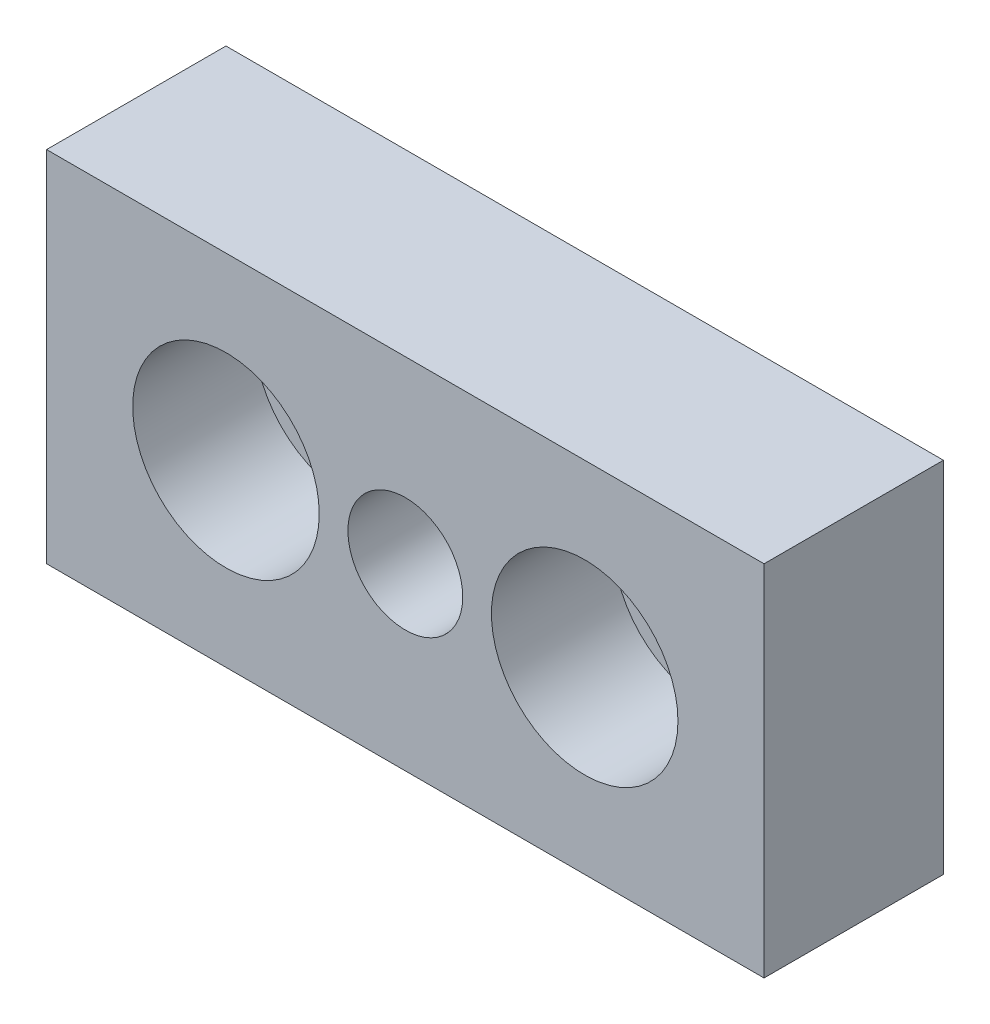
ISO-10303-21;
HEADER;
FILE_DESCRIPTION(('STEP AP214'),'2;1');
FILE_NAME('part.step','',(''),(''),'','','');
FILE_SCHEMA(('AUTOMOTIVE_DESIGN { 1 0 10303 214 1 1 1 1 }'));
ENDSEC;
DATA;
#1=APPLICATION_CONTEXT('core data for automotive mechanical design processes');
#2=APPLICATION_PROTOCOL_DEFINITION('international standard','automotive_design',2000,#1);
#3=PRODUCT_CONTEXT('',#1,'mechanical');
#4=PRODUCT('Part','Part','',(#3));
#5=PRODUCT_RELATED_PRODUCT_CATEGORY('part','',(#4));
#6=PRODUCT_DEFINITION_FORMATION('','',#4);
#7=PRODUCT_DEFINITION_CONTEXT('part definition',#1,'design');
#8=PRODUCT_DEFINITION('design','',#6,#7);
#9=PRODUCT_DEFINITION_SHAPE('','',#8);
#10=(LENGTH_UNIT() NAMED_UNIT(*) SI_UNIT(.MILLI.,.METRE.));
#11=(NAMED_UNIT(*) PLANE_ANGLE_UNIT() SI_UNIT($,.RADIAN.));
#12=(NAMED_UNIT(*) SI_UNIT($,.STERADIAN.) SOLID_ANGLE_UNIT());
#13=UNCERTAINTY_MEASURE_WITH_UNIT(LENGTH_MEASURE(1.E-05),#10,'distance_accuracy_value','');
#14=(GEOMETRIC_REPRESENTATION_CONTEXT(3) GLOBAL_UNCERTAINTY_ASSIGNED_CONTEXT((#13)) GLOBAL_UNIT_ASSIGNED_CONTEXT((#10,
#11,#12)) REPRESENTATION_CONTEXT('',''));
#15=CARTESIAN_POINT('',(0.,0.,0.));
#16=DIRECTION('',(0.,0.,1.));
#17=DIRECTION('',(1.,0.,0.));
#18=AXIS2_PLACEMENT_3D('',#15,#16,#17);
#19=CARTESIAN_POINT('',(-25.,25.,25.));
#20=DIRECTION('',(0.,0.,-1.));
#21=DIRECTION('',(-1.,0.,0.));
#22=AXIS2_PLACEMENT_3D('',#19,#20,#21);
#23=PLANE('',#22);
#24=CARTESIAN_POINT('',(0.,0.,25.));
#25=DIRECTION('',(0.,0.,1.));
#26=DIRECTION('',(1.,0.,0.));
#27=AXIS2_PLACEMENT_3D('',#24,#25,#26);
#28=CIRCLE('',#27,13.);
#29=CARTESIAN_POINT('',(13.,0.,25.));
#30=VERTEX_POINT('',#29);
#31=EDGE_CURVE('E164',#30,#30,#28,.T.);
#32=ORIENTED_EDGE('',*,*,#31,.F.);
#33=EDGE_LOOP('',(#32));
#34=FACE_BOUND('',#33,.T.);
#35=DIRECTION('',(0.,1.,0.));
#36=VECTOR('',#35,1.);
#37=CARTESIAN_POINT('',(-25.,-25.,25.));
#38=LINE('',#37,#36);
#39=CARTESIAN_POINT('',(-25.,-25.,25.));
#40=VERTEX_POINT('',#39);
#41=CARTESIAN_POINT('',(-25.,25.,25.));
#42=VERTEX_POINT('',#41);
#43=EDGE_CURVE('E66',#40,#42,#38,.T.);
#44=ORIENTED_EDGE('',*,*,#43,.F.);
#45=DIRECTION('',(-1.,0.,0.));
#46=VECTOR('',#45,1.);
#47=CARTESIAN_POINT('',(75.,-25.,25.));
#48=LINE('',#47,#46);
#49=CARTESIAN_POINT('',(75.,-25.,25.));
#50=VERTEX_POINT('',#49);
#51=EDGE_CURVE('E48',#50,#40,#48,.T.);
#52=ORIENTED_EDGE('',*,*,#51,.F.);
#53=DIRECTION('',(0.,-1.,0.));
#54=VECTOR('',#53,1.);
#55=CARTESIAN_POINT('',(75.,25.,25.));
#56=LINE('',#55,#54);
#57=CARTESIAN_POINT('',(75.,25.,25.));
#58=VERTEX_POINT('',#57);
#59=EDGE_CURVE('E57',#58,#50,#56,.T.);
#60=ORIENTED_EDGE('',*,*,#59,.F.);
#61=DIRECTION('',(1.,0.,0.));
#62=VECTOR('',#61,1.);
#63=CARTESIAN_POINT('',(-25.,25.,25.));
#64=LINE('',#63,#62);
#65=EDGE_CURVE('E62',#42,#58,#64,.T.);
#66=ORIENTED_EDGE('',*,*,#65,.F.);
#67=EDGE_LOOP('',(#44,#52,#60,#66));
#68=FACE_BOUND('',#67,.T.);
#69=CARTESIAN_POINT('',(25.,0.,25.));
#70=DIRECTION('',(0.,0.,1.));
#71=DIRECTION('',(1.,0.,0.));
#72=AXIS2_PLACEMENT_3D('',#69,#70,#71);
#73=CIRCLE('',#72,8.);
#74=CARTESIAN_POINT('',(33.,0.,25.));
#75=VERTEX_POINT('',#74);
#76=EDGE_CURVE('E84',#75,#75,#73,.T.);
#77=ORIENTED_EDGE('',*,*,#76,.F.);
#78=EDGE_LOOP('',(#77));
#79=FACE_BOUND('',#78,.T.);
#80=CARTESIAN_POINT('',(50.,0.,25.));
#81=DIRECTION('',(0.,0.,1.));
#82=DIRECTION('',(1.,0.,0.));
#83=AXIS2_PLACEMENT_3D('',#80,#81,#82);
#84=CIRCLE('',#83,13.);
#85=CARTESIAN_POINT('',(63.,0.,25.));
#86=VERTEX_POINT('',#85);
#87=EDGE_CURVE('E152',#86,#86,#84,.T.);
#88=ORIENTED_EDGE('',*,*,#87,.F.);
#89=EDGE_LOOP('',(#88));
#90=FACE_BOUND('',#89,.T.);
#91=ADVANCED_FACE('F14',(#34,#68,#79,#90),#23,.F.);
#92=CARTESIAN_POINT('',(-25.,25.,0.));
#93=DIRECTION('',(0.,0.,-1.));
#94=DIRECTION('',(-1.,0.,0.));
#95=AXIS2_PLACEMENT_3D('',#92,#93,#94);
#96=PLANE('',#95);
#97=CARTESIAN_POINT('',(0.,0.,0.));
#98=DIRECTION('',(0.,0.,1.));
#99=DIRECTION('',(1.,0.,0.));
#100=AXIS2_PLACEMENT_3D('',#97,#98,#99);
#101=CIRCLE('',#100,9.);
#102=CARTESIAN_POINT('',(9.,0.,0.));
#103=VERTEX_POINT('',#102);
#104=EDGE_CURVE('E155',#103,#103,#101,.T.);
#105=ORIENTED_EDGE('',*,*,#104,.T.);
#106=EDGE_LOOP('',(#105));
#107=FACE_BOUND('',#106,.T.);
#108=DIRECTION('',(0.,1.,0.));
#109=VECTOR('',#108,1.);
#110=CARTESIAN_POINT('',(-25.,-25.,0.));
#111=LINE('',#110,#109);
#112=CARTESIAN_POINT('',(-25.,-25.,0.));
#113=VERTEX_POINT('',#112);
#114=CARTESIAN_POINT('',(-25.,25.,0.));
#115=VERTEX_POINT('',#114);
#116=EDGE_CURVE('E67',#113,#115,#111,.T.);
#117=ORIENTED_EDGE('',*,*,#116,.T.);
#118=DIRECTION('',(1.,0.,0.));
#119=VECTOR('',#118,1.);
#120=CARTESIAN_POINT('',(-25.,25.,0.));
#121=LINE('',#120,#119);
#122=CARTESIAN_POINT('',(75.,25.,0.));
#123=VERTEX_POINT('',#122);
#124=EDGE_CURVE('E70',#115,#123,#121,.T.);
#125=ORIENTED_EDGE('',*,*,#124,.T.);
#126=DIRECTION('',(0.,-1.,0.));
#127=VECTOR('',#126,1.);
#128=CARTESIAN_POINT('',(75.,25.,0.));
#129=LINE('',#128,#127);
#130=CARTESIAN_POINT('',(75.,-25.,0.));
#131=VERTEX_POINT('',#130);
#132=EDGE_CURVE('E80',#123,#131,#129,.T.);
#133=ORIENTED_EDGE('',*,*,#132,.T.);
#134=DIRECTION('',(-1.,0.,0.));
#135=VECTOR('',#134,1.);
#136=CARTESIAN_POINT('',(75.,-25.,0.));
#137=LINE('',#136,#135);
#138=EDGE_CURVE('E51',#131,#113,#137,.T.);
#139=ORIENTED_EDGE('',*,*,#138,.T.);
#140=EDGE_LOOP('',(#117,#125,#133,#139));
#141=FACE_BOUND('',#140,.T.);
#142=CARTESIAN_POINT('',(25.,0.,0.));
#143=DIRECTION('',(0.,0.,1.));
#144=DIRECTION('',(1.,0.,0.));
#145=AXIS2_PLACEMENT_3D('',#142,#143,#144);
#146=CIRCLE('',#145,8.);
#147=CARTESIAN_POINT('',(33.,0.,0.));
#148=VERTEX_POINT('',#147);
#149=EDGE_CURVE('E167',#148,#148,#146,.T.);
#150=ORIENTED_EDGE('',*,*,#149,.T.);
#151=EDGE_LOOP('',(#150));
#152=FACE_BOUND('',#151,.T.);
#153=CARTESIAN_POINT('',(50.,0.,0.));
#154=DIRECTION('',(0.,0.,1.));
#155=DIRECTION('',(1.,0.,0.));
#156=AXIS2_PLACEMENT_3D('',#153,#154,#155);
#157=CIRCLE('',#156,9.);
#158=CARTESIAN_POINT('',(59.,0.,0.));
#159=VERTEX_POINT('',#158);
#160=EDGE_CURVE('E144',#159,#159,#157,.T.);
#161=ORIENTED_EDGE('',*,*,#160,.T.);
#162=EDGE_LOOP('',(#161));
#163=FACE_BOUND('',#162,.T.);
#164=ADVANCED_FACE('F78',(#107,#141,#152,#163),#96,.T.);
#165=CARTESIAN_POINT('',(-25.,-25.,25.));
#166=DIRECTION('',(-1.,0.,0.));
#167=DIRECTION('',(0.,0.,1.));
#168=AXIS2_PLACEMENT_3D('',#165,#166,#167);
#169=PLANE('',#168);
#170=DIRECTION('',(0.,0.,-1.));
#171=VECTOR('',#170,1.);
#172=CARTESIAN_POINT('',(-25.,-25.,25.));
#173=LINE('',#172,#171);
#174=EDGE_CURVE('E9',#40,#113,#173,.T.);
#175=ORIENTED_EDGE('',*,*,#174,.F.);
#176=ORIENTED_EDGE('',*,*,#43,.T.);
#177=DIRECTION('',(0.,0.,-1.));
#178=VECTOR('',#177,1.);
#179=CARTESIAN_POINT('',(-25.,25.,25.));
#180=LINE('',#179,#178);
#181=EDGE_CURVE('E30',#42,#115,#180,.T.);
#182=ORIENTED_EDGE('',*,*,#181,.T.);
#183=ORIENTED_EDGE('',*,*,#116,.F.);
#184=EDGE_LOOP('',(#175,#176,#182,#183));
#185=FACE_BOUND('',#184,.T.);
#186=ADVANCED_FACE('F88',(#185),#169,.T.);
#187=CARTESIAN_POINT('',(75.,-25.,25.));
#188=DIRECTION('',(0.,-1.,0.));
#189=DIRECTION('',(1.,0.,0.));
#190=AXIS2_PLACEMENT_3D('',#187,#188,#189);
#191=PLANE('',#190);
#192=DIRECTION('',(0.,0.,-1.));
#193=VECTOR('',#192,1.);
#194=CARTESIAN_POINT('',(75.,-25.,25.));
#195=LINE('',#194,#193);
#196=EDGE_CURVE('E23',#50,#131,#195,.T.);
#197=ORIENTED_EDGE('',*,*,#196,.F.);
#198=ORIENTED_EDGE('',*,*,#51,.T.);
#199=ORIENTED_EDGE('',*,*,#174,.T.);
#200=ORIENTED_EDGE('',*,*,#138,.F.);
#201=EDGE_LOOP('',(#197,#198,#199,#200));
#202=FACE_BOUND('',#201,.T.);
#203=ADVANCED_FACE('F16',(#202),#191,.T.);
#204=CARTESIAN_POINT('',(75.,25.,25.));
#205=DIRECTION('',(1.,0.,0.));
#206=DIRECTION('',(0.,1.,0.));
#207=AXIS2_PLACEMENT_3D('',#204,#205,#206);
#208=PLANE('',#207);
#209=DIRECTION('',(0.,0.,-1.));
#210=VECTOR('',#209,1.);
#211=CARTESIAN_POINT('',(75.,25.,25.));
#212=LINE('',#211,#210);
#213=EDGE_CURVE('E55',#58,#123,#212,.T.);
#214=ORIENTED_EDGE('',*,*,#213,.F.);
#215=ORIENTED_EDGE('',*,*,#59,.T.);
#216=ORIENTED_EDGE('',*,*,#196,.T.);
#217=ORIENTED_EDGE('',*,*,#132,.F.);
#218=EDGE_LOOP('',(#214,#215,#216,#217));
#219=FACE_BOUND('',#218,.T.);
#220=ADVANCED_FACE('F58',(#219),#208,.T.);
#221=CARTESIAN_POINT('',(-25.,25.,25.));
#222=DIRECTION('',(0.,1.,0.));
#223=DIRECTION('',(0.,0.,1.));
#224=AXIS2_PLACEMENT_3D('',#221,#222,#223);
#225=PLANE('',#224);
#226=ORIENTED_EDGE('',*,*,#65,.T.);
#227=ORIENTED_EDGE('',*,*,#213,.T.);
#228=ORIENTED_EDGE('',*,*,#124,.F.);
#229=ORIENTED_EDGE('',*,*,#181,.F.);
#230=EDGE_LOOP('',(#226,#227,#228,#229));
#231=FACE_BOUND('',#230,.T.);
#232=ADVANCED_FACE('F76',(#231),#225,.T.);
#233=CARTESIAN_POINT('',(25.,0.,25.));
#234=DIRECTION('',(0.,0.,-1.));
#235=DIRECTION('',(-1.,0.,0.));
#236=AXIS2_PLACEMENT_3D('',#233,#234,#235);
#237=CYLINDRICAL_SURFACE('',#236,8.);
#238=ORIENTED_EDGE('',*,*,#76,.T.);
#239=EDGE_LOOP('',(#238));
#240=FACE_BOUND('',#239,.T.);
#241=ORIENTED_EDGE('',*,*,#149,.F.);
#242=EDGE_LOOP('',(#241));
#243=FACE_BOUND('',#242,.T.);
#244=ADVANCED_FACE('F109',(#240,#243),#237,.F.);
#245=CARTESIAN_POINT('',(0.,0.,25.));
#246=DIRECTION('',(0.,0.,1.));
#247=DIRECTION('',(1.,0.,0.));
#248=AXIS2_PLACEMENT_3D('',#245,#246,#247);
#249=CYLINDRICAL_SURFACE('',#248,13.);
#250=ORIENTED_EDGE('',*,*,#31,.T.);
#251=EDGE_LOOP('',(#250));
#252=FACE_BOUND('',#251,.T.);
#253=CARTESIAN_POINT('',(0.,0.,8.));
#254=DIRECTION('',(0.,0.,1.));
#255=DIRECTION('',(1.,0.,0.));
#256=AXIS2_PLACEMENT_3D('',#253,#254,#255);
#257=CIRCLE('',#256,13.);
#258=CARTESIAN_POINT('',(13.,0.,8.));
#259=VERTEX_POINT('',#258);
#260=EDGE_CURVE('E161',#259,#259,#257,.T.);
#261=ORIENTED_EDGE('',*,*,#260,.F.);
#262=EDGE_LOOP('',(#261));
#263=FACE_BOUND('',#262,.T.);
#264=ADVANCED_FACE('F112',(#252,#263),#249,.F.);
#265=CARTESIAN_POINT('',(9.,0.,8.));
#266=DIRECTION('',(0.,0.,1.));
#267=DIRECTION('',(1.,0.,0.));
#268=AXIS2_PLACEMENT_3D('',#265,#266,#267);
#269=PLANE('',#268);
#270=ORIENTED_EDGE('',*,*,#260,.T.);
#271=EDGE_LOOP('',(#270));
#272=FACE_BOUND('',#271,.T.);
#273=CARTESIAN_POINT('',(0.,0.,8.));
#274=DIRECTION('',(0.,0.,1.));
#275=DIRECTION('',(1.,0.,0.));
#276=AXIS2_PLACEMENT_3D('',#273,#274,#275);
#277=CIRCLE('',#276,9.);
#278=CARTESIAN_POINT('',(9.,0.,8.));
#279=VERTEX_POINT('',#278);
#280=EDGE_CURVE('E158',#279,#279,#277,.T.);
#281=ORIENTED_EDGE('',*,*,#280,.F.);
#282=EDGE_LOOP('',(#281));
#283=FACE_BOUND('',#282,.T.);
#284=ADVANCED_FACE('F116',(#272,#283),#269,.T.);
#285=CARTESIAN_POINT('',(0.,0.,25.));
#286=DIRECTION('',(0.,0.,1.));
#287=DIRECTION('',(1.,0.,0.));
#288=AXIS2_PLACEMENT_3D('',#285,#286,#287);
#289=CYLINDRICAL_SURFACE('',#288,9.);
#290=ORIENTED_EDGE('',*,*,#280,.T.);
#291=EDGE_LOOP('',(#290));
#292=FACE_BOUND('',#291,.T.);
#293=ORIENTED_EDGE('',*,*,#104,.F.);
#294=EDGE_LOOP('',(#293));
#295=FACE_BOUND('',#294,.T.);
#296=ADVANCED_FACE('F120',(#292,#295),#289,.F.);
#297=CARTESIAN_POINT('',(50.,0.,25.));
#298=DIRECTION('',(0.,0.,1.));
#299=DIRECTION('',(1.,0.,0.));
#300=AXIS2_PLACEMENT_3D('',#297,#298,#299);
#301=CYLINDRICAL_SURFACE('',#300,13.);
#302=ORIENTED_EDGE('',*,*,#87,.T.);
#303=EDGE_LOOP('',(#302));
#304=FACE_BOUND('',#303,.T.);
#305=CARTESIAN_POINT('',(50.,0.,8.));
#306=DIRECTION('',(0.,0.,1.));
#307=DIRECTION('',(1.,0.,0.));
#308=AXIS2_PLACEMENT_3D('',#305,#306,#307);
#309=CIRCLE('',#308,13.);
#310=CARTESIAN_POINT('',(63.,0.,8.));
#311=VERTEX_POINT('',#310);
#312=EDGE_CURVE('E147',#311,#311,#309,.T.);
#313=ORIENTED_EDGE('',*,*,#312,.F.);
#314=EDGE_LOOP('',(#313));
#315=FACE_BOUND('',#314,.T.);
#316=ADVANCED_FACE('F124',(#304,#315),#301,.F.);
#317=CARTESIAN_POINT('',(59.,0.,8.));
#318=DIRECTION('',(0.,0.,1.));
#319=DIRECTION('',(1.,0.,0.));
#320=AXIS2_PLACEMENT_3D('',#317,#318,#319);
#321=PLANE('',#320);
#322=ORIENTED_EDGE('',*,*,#312,.T.);
#323=EDGE_LOOP('',(#322));
#324=FACE_BOUND('',#323,.T.);
#325=CARTESIAN_POINT('',(50.,0.,8.));
#326=DIRECTION('',(0.,0.,1.));
#327=DIRECTION('',(1.,0.,0.));
#328=AXIS2_PLACEMENT_3D('',#325,#326,#327);
#329=CIRCLE('',#328,9.);
#330=CARTESIAN_POINT('',(59.,0.,8.));
#331=VERTEX_POINT('',#330);
#332=EDGE_CURVE('E141',#331,#331,#329,.T.);
#333=ORIENTED_EDGE('',*,*,#332,.F.);
#334=EDGE_LOOP('',(#333));
#335=FACE_BOUND('',#334,.T.);
#336=ADVANCED_FACE('F128',(#324,#335),#321,.T.);
#337=CARTESIAN_POINT('',(50.,0.,25.));
#338=DIRECTION('',(0.,0.,1.));
#339=DIRECTION('',(1.,0.,0.));
#340=AXIS2_PLACEMENT_3D('',#337,#338,#339);
#341=CYLINDRICAL_SURFACE('',#340,9.);
#342=ORIENTED_EDGE('',*,*,#332,.T.);
#343=EDGE_LOOP('',(#342));
#344=FACE_BOUND('',#343,.T.);
#345=ORIENTED_EDGE('',*,*,#160,.F.);
#346=EDGE_LOOP('',(#345));
#347=FACE_BOUND('',#346,.T.);
#348=ADVANCED_FACE('F132',(#344,#347),#341,.F.);
#349=CLOSED_SHELL('',(#91,#164,#186,#203,#220,#232,#244,#264,#284,#296,#316,#336,#348));
#350=MANIFOLD_SOLID_BREP('B1',#349);
#351=ADVANCED_BREP_SHAPE_REPRESENTATION('',(#18,#350),#14);
#352=SHAPE_DEFINITION_REPRESENTATION(#9,#351);
ENDSEC;
END-ISO-10303-21;
